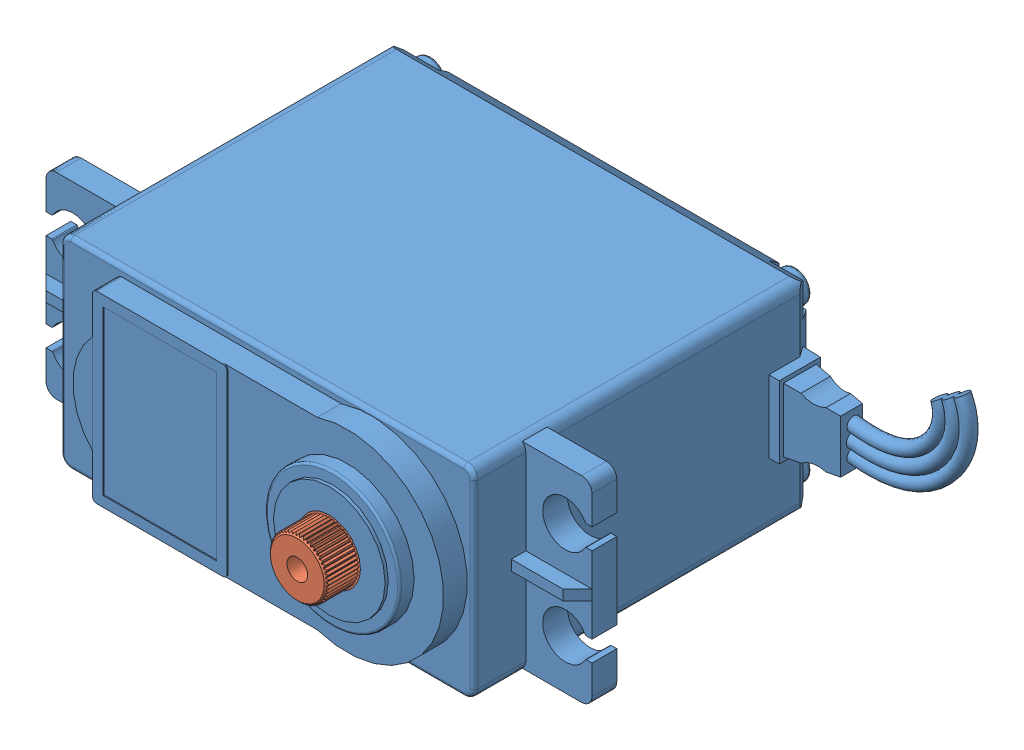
SolidWorks assembly HS422_Assemblé_sans_palonnier.SLDASM, configuration Défaut (file format 9000). Lengths in mm.
Overall size (64.18 19.5 40.65).
2 component instances, 2 part files, 2 mates.
Components (placement in the parent):
- corps_HS422-1: corps_HS422.SLDPRT [Défaut] at (-19.2808 3.2298 -18.7251) size (64.18 19.5 37.55)
- axe_HS422-1: axe_HS422.SLDPRT [Défaut] at (-9.2808 3.2298 18.2749) x (0.266065 -0.963955 0) z (0 0 1) size (6 6 3.6)
Mates (geometry in assembly coordinates):
- Coaxiale2: concentric anti-aligned: cylinder of corps_HS422-1 through (-9.2808 3.2298 17.7749) axis (0 0 1) radius 3; cylinder of axe_HS422-1 through (-9.2808 3.2298 18.7749) axis (0 0 -1) radius 3
- Coïncidente3: coincident aligned: plane of corps_HS422-1 through (-9.2808 3.2298 18.7749) normal (0 0 1); circle of axe_HS422-1
